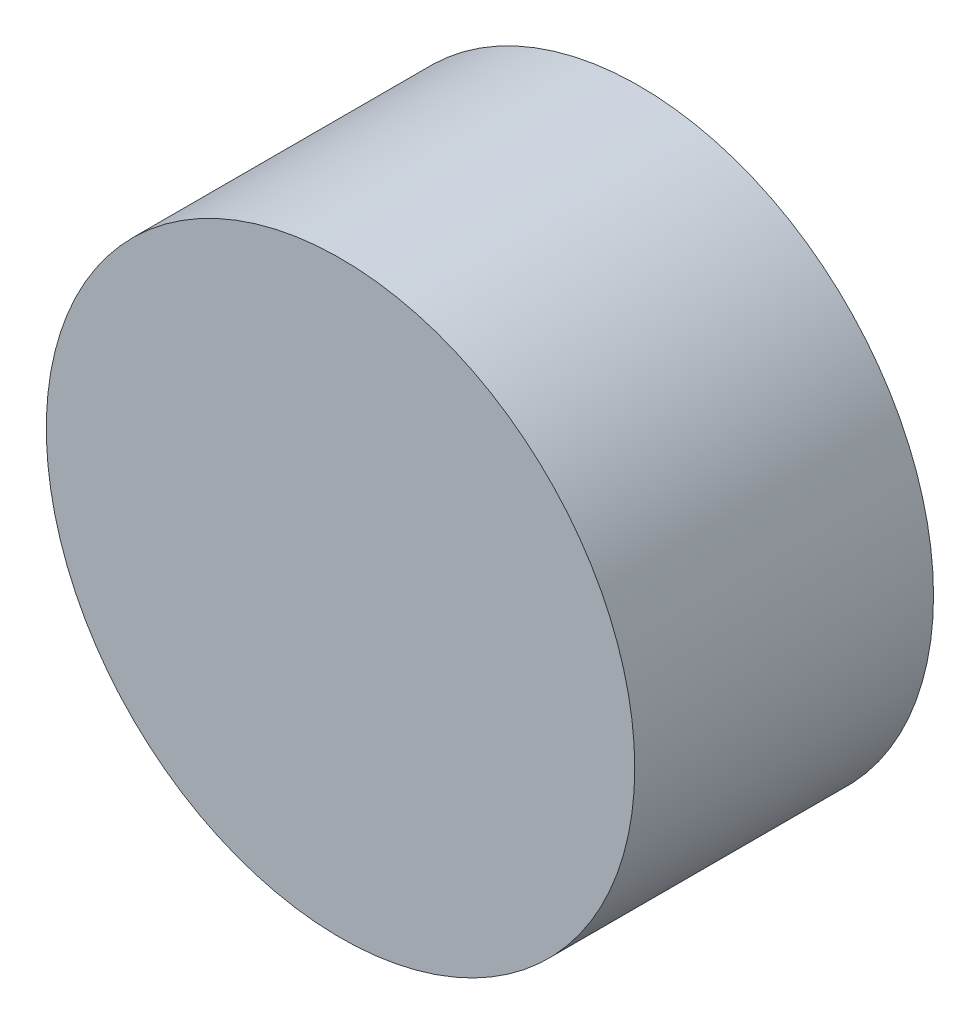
ISO-10303-21;
HEADER;
FILE_DESCRIPTION(('STEP AP214'),'2;1');
FILE_NAME('part.step','',(''),(''),'','','');
FILE_SCHEMA(('AUTOMOTIVE_DESIGN { 1 0 10303 214 1 1 1 1 }'));
ENDSEC;
DATA;
#1=APPLICATION_CONTEXT('core data for automotive mechanical design processes');
#2=APPLICATION_PROTOCOL_DEFINITION('international standard','automotive_design',2000,#1);
#3=PRODUCT_CONTEXT('',#1,'mechanical');
#4=PRODUCT('Part','Part','',(#3));
#5=PRODUCT_RELATED_PRODUCT_CATEGORY('part','',(#4));
#6=PRODUCT_DEFINITION_FORMATION('','',#4);
#7=PRODUCT_DEFINITION_CONTEXT('part definition',#1,'design');
#8=PRODUCT_DEFINITION('design','',#6,#7);
#9=PRODUCT_DEFINITION_SHAPE('','',#8);
#10=(LENGTH_UNIT() NAMED_UNIT(*) SI_UNIT(.MILLI.,.METRE.));
#11=(NAMED_UNIT(*) PLANE_ANGLE_UNIT() SI_UNIT($,.RADIAN.));
#12=(NAMED_UNIT(*) SI_UNIT($,.STERADIAN.) SOLID_ANGLE_UNIT());
#13=UNCERTAINTY_MEASURE_WITH_UNIT(LENGTH_MEASURE(1.E-05),#10,'distance_accuracy_value','');
#14=(GEOMETRIC_REPRESENTATION_CONTEXT(3) GLOBAL_UNCERTAINTY_ASSIGNED_CONTEXT((#13)) GLOBAL_UNIT_ASSIGNED_CONTEXT((#10,
#11,#12)) REPRESENTATION_CONTEXT('',''));
#15=CARTESIAN_POINT('',(0.,0.,0.));
#16=DIRECTION('',(0.,0.,1.));
#17=DIRECTION('',(1.,0.,0.));
#18=AXIS2_PLACEMENT_3D('',#15,#16,#17);
#19=CARTESIAN_POINT('',(0.,0.,33.));
#20=DIRECTION('',(0.,0.,-1.));
#21=DIRECTION('',(-1.,0.,0.));
#22=AXIS2_PLACEMENT_3D('',#19,#20,#21);
#23=CYLINDRICAL_SURFACE('',#22,32.5);
#24=CARTESIAN_POINT('',(0.,0.,33.));
#25=DIRECTION('',(0.,0.,1.));
#26=DIRECTION('',(1.,0.,0.));
#27=AXIS2_PLACEMENT_3D('',#24,#25,#26);
#28=CIRCLE('',#27,32.5);
#29=CARTESIAN_POINT('',(32.5,0.,33.));
#30=VERTEX_POINT('',#29);
#31=EDGE_CURVE('E10',#30,#30,#28,.T.);
#32=ORIENTED_EDGE('',*,*,#31,.F.);
#33=EDGE_LOOP('',(#32));
#34=FACE_BOUND('',#33,.T.);
#35=CARTESIAN_POINT('',(0.,0.,0.));
#36=DIRECTION('',(0.,0.,1.));
#37=DIRECTION('',(1.,0.,0.));
#38=AXIS2_PLACEMENT_3D('',#35,#36,#37);
#39=CIRCLE('',#38,32.5);
#40=CARTESIAN_POINT('',(32.5,0.,0.));
#41=VERTEX_POINT('',#40);
#42=EDGE_CURVE('E45',#41,#41,#39,.T.);
#43=ORIENTED_EDGE('',*,*,#42,.T.);
#44=EDGE_LOOP('',(#43));
#45=FACE_BOUND('',#44,.T.);
#46=ADVANCED_FACE('F39',(#34,#45),#23,.T.);
#47=CARTESIAN_POINT('',(0.,0.,33.));
#48=DIRECTION('',(0.,0.,1.));
#49=DIRECTION('',(1.,0.,0.));
#50=AXIS2_PLACEMENT_3D('',#47,#48,#49);
#51=PLANE('',#50);
#52=ORIENTED_EDGE('',*,*,#31,.T.);
#53=EDGE_LOOP('',(#52));
#54=FACE_BOUND('',#53,.T.);
#55=ADVANCED_FACE('F53',(#54),#51,.T.);
#56=CARTESIAN_POINT('',(0.,0.,0.));
#57=DIRECTION('',(0.,0.,1.));
#58=DIRECTION('',(1.,0.,0.));
#59=AXIS2_PLACEMENT_3D('',#56,#57,#58);
#60=PLANE('',#59);
#61=ORIENTED_EDGE('',*,*,#42,.F.);
#62=EDGE_LOOP('',(#61));
#63=FACE_BOUND('',#62,.T.);
#64=ADVANCED_FACE('F55',(#63),#60,.F.);
#65=CLOSED_SHELL('',(#46,#55,#64));
#66=MANIFOLD_SOLID_BREP('B2',#65);
#67=ADVANCED_BREP_SHAPE_REPRESENTATION('',(#18,#66),#14);
#68=SHAPE_DEFINITION_REPRESENTATION(#9,#67);
ENDSEC;
END-ISO-10303-21;
